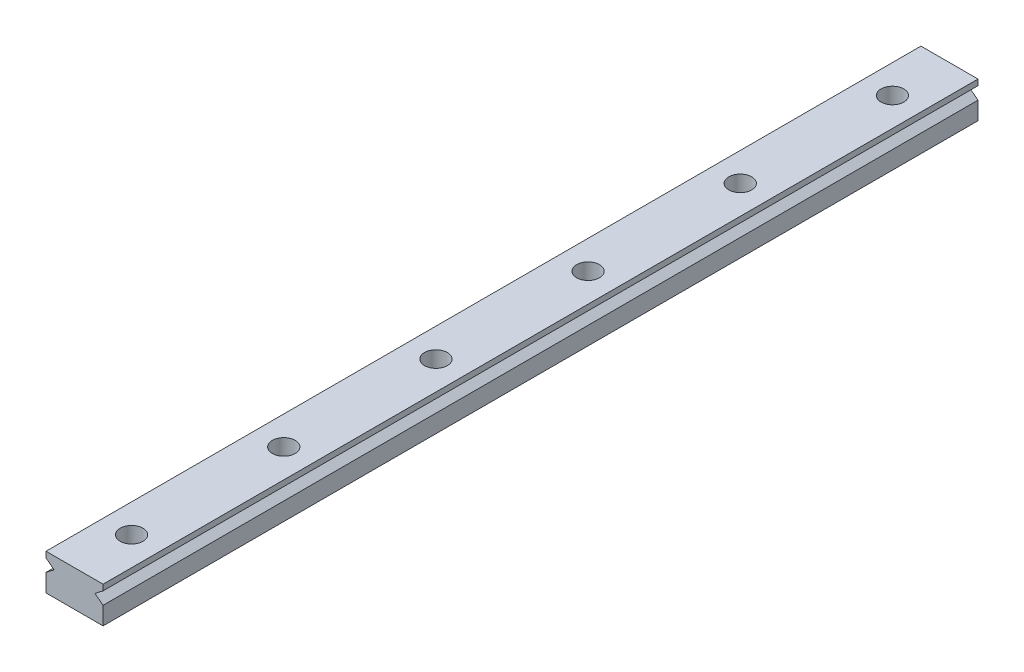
from build123d import *

# Parameters (mm, degrees)
RAIL_DEPTH      = 230
LPATTERN1_COUNT = 6
LPATTERN1_PITCH = 40


with BuildPart() as part:
    # Sketch2 → Rail (new body)
    with BuildSketch(Plane.XY):
        Polygon((-7.5, 0), (7.5, 0), (7.5, 4.689061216), (5.357142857, 6.333333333), (7.5, 7.97760545), (7.5, 9.5), (-7.5, 9.5), (-7.5, 7.97760545), (-5.357142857, 6.333333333), (-7.5, 4.689061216), align=None)
    extrude(amount=-RAIL_DEPTH)

    # Sketch6 → C_Bore (revolve, cut)
    with BuildSketch(Plane(origin=(0, 0, 0), x_dir=(0, 0, -1), z_dir=(1, 0, 0)), mode=Mode.PRIVATE) as c_bore_sk:
        Polygon((215, 9.5), (218, 9.5), (218, 5), (216.75, 5), (216.75, 0), (215, 0), align=None)
    c_bore = revolve(c_bore_sk.sketch.rotate(Axis((0, 8.904905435, -215), (0, -1, 0)), 180), axis=Axis((0, 8.904905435, -215), (0, -1, 0)), mode=Mode.SUBTRACT)

    # LPattern1: C_Bore ×6
    with Locations(*[(0, 0, i * LPATTERN1_PITCH) for i in range(1, LPATTERN1_COUNT)]):
        add(c_bore, mode=Mode.SUBTRACT)


solid = part.part
